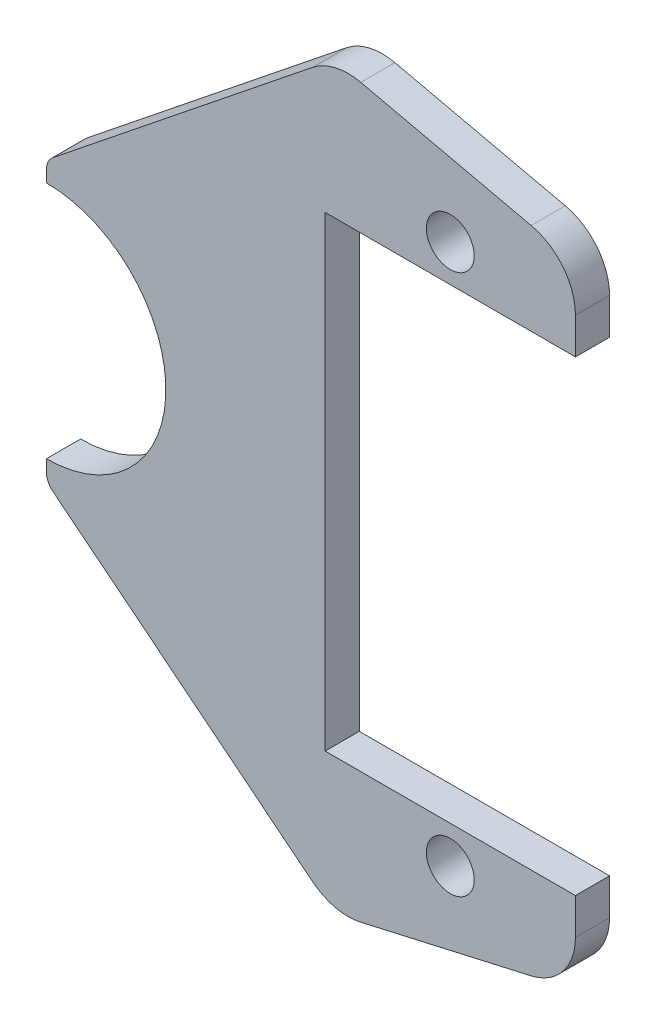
from build123d import *

# Parameters (mm, degrees)
ESQUISSE1_R      = 4.2
EXTRUSION1_DEPTH = 6


with BuildPart() as part:
    # Esquisse1 → Extrusion1 (new body)
    with BuildSketch(Plane.XY):
        with BuildLine():
            Line((49, -41), (49, 41))
            Line((49, 41), (93, 41))
            Line((93, 41), (93, 47.373215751))
            ThreePointArc((93, 47.373215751), (90.815204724, 53.612011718), (85.215484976, 57.124709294))
            Line((85.215484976, 57.124709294), (55.255825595, 63.931376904))
            ThreePointArc((55.255825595, 63.931376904), (50.799333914, 63.925543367), (46.787914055, 61.984187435))
            Line((46.787914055, 61.984187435), (1.124272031, 25.400711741))
            ThreePointArc((1.124272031, 25.400711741), (0.295634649, 24.358038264), (0, 23.059420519))
            Line((0, 23.059420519), (0, 21))
            ThreePointArc((0, 21), (21, 0), (0, -21))
            Line((0, -21), (0, -23.059420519))
            ThreePointArc((0, -23.059420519), (0.295634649, -24.358038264), (1.124272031, -25.400711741))
            Line((1.124272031, -25.400711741), (46.787914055, -61.984187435))
            ThreePointArc((46.787914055, -61.984187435), (50.799333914, -63.925543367), (55.255825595, -63.931376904))
            Line((55.255825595, -63.931376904), (85.215484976, -57.124709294))
            ThreePointArc((85.215484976, -57.124709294), (90.815204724, -53.612011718), (93, -47.373215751))
            Line((93, -47.373215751), (93, -41))
            Line((93, -41), (49, -41))
        make_face()
        with Locations((71, 47.5)):
            Circle(ESQUISSE1_R, mode=Mode.SUBTRACT)
        with Locations(Location((71, -47.5, 0), (0, 0, 180))):
            Circle(ESQUISSE1_R, mode=Mode.SUBTRACT)
    extrude(amount=EXTRUSION1_DEPTH)


solid = part.part
